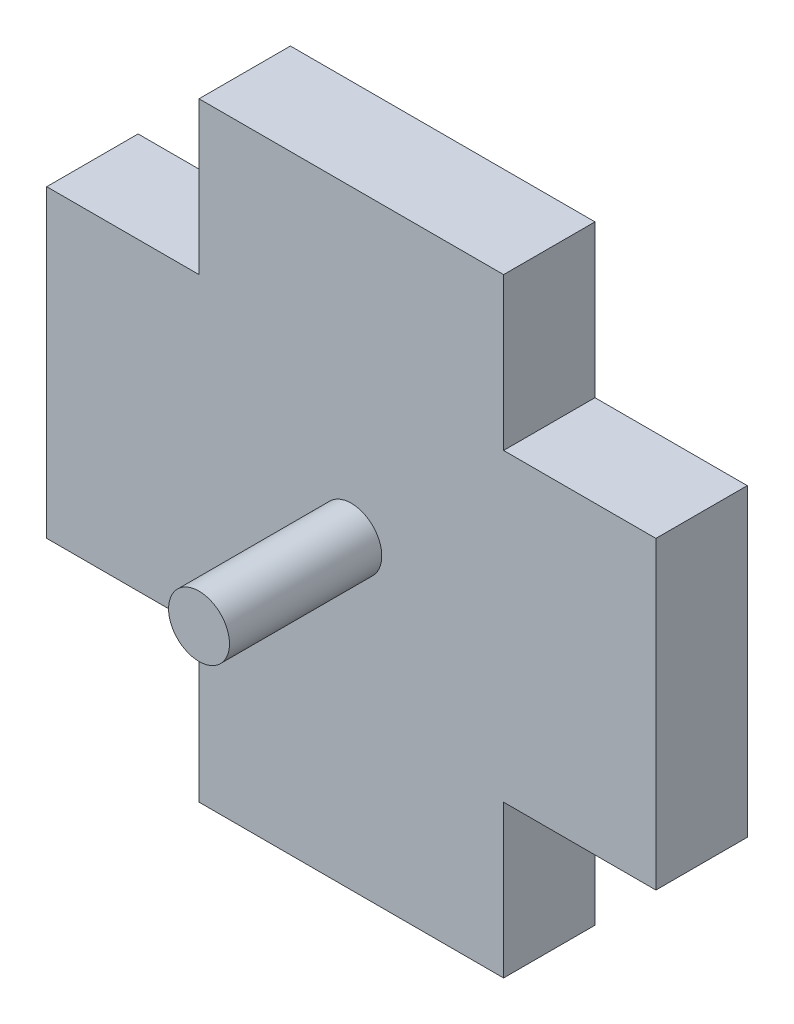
ISO-10303-21;
HEADER;
FILE_DESCRIPTION(('STEP AP214'),'2;1');
FILE_NAME('part.step','',(''),(''),'','','');
FILE_SCHEMA(('AUTOMOTIVE_DESIGN { 1 0 10303 214 1 1 1 1 }'));
ENDSEC;
DATA;
#1=APPLICATION_CONTEXT('core data for automotive mechanical design processes');
#2=APPLICATION_PROTOCOL_DEFINITION('international standard','automotive_design',2000,#1);
#3=PRODUCT_CONTEXT('',#1,'mechanical');
#4=PRODUCT('Part','Part','',(#3));
#5=PRODUCT_RELATED_PRODUCT_CATEGORY('part','',(#4));
#6=PRODUCT_DEFINITION_FORMATION('','',#4);
#7=PRODUCT_DEFINITION_CONTEXT('part definition',#1,'design');
#8=PRODUCT_DEFINITION('design','',#6,#7);
#9=PRODUCT_DEFINITION_SHAPE('','',#8);
#10=(LENGTH_UNIT() NAMED_UNIT(*) SI_UNIT(.MILLI.,.METRE.));
#11=(NAMED_UNIT(*) PLANE_ANGLE_UNIT() SI_UNIT($,.RADIAN.));
#12=(NAMED_UNIT(*) SI_UNIT($,.STERADIAN.) SOLID_ANGLE_UNIT());
#13=UNCERTAINTY_MEASURE_WITH_UNIT(LENGTH_MEASURE(1.E-05),#10,'distance_accuracy_value','');
#14=(GEOMETRIC_REPRESENTATION_CONTEXT(3) GLOBAL_UNCERTAINTY_ASSIGNED_CONTEXT((#13)) GLOBAL_UNIT_ASSIGNED_CONTEXT((#10,
#11,#12)) REPRESENTATION_CONTEXT('',''));
#15=CARTESIAN_POINT('',(0.,0.,0.));
#16=DIRECTION('',(0.,0.,1.));
#17=DIRECTION('',(1.,0.,0.));
#18=AXIS2_PLACEMENT_3D('',#15,#16,#17);
#19=CARTESIAN_POINT('',(-10.,5.,0.));
#20=DIRECTION('',(0.,0.,-1.));
#21=DIRECTION('',(-1.,0.,0.));
#22=AXIS2_PLACEMENT_3D('',#19,#20,#21);
#23=PLANE('',#22);
#24=DIRECTION('',(0.,-1.,0.));
#25=VECTOR('',#24,1.);
#26=CARTESIAN_POINT('',(-10.,-5.,0.));
#27=LINE('',#26,#25);
#28=CARTESIAN_POINT('',(-10.,5.,0.));
#29=VERTEX_POINT('',#28);
#30=CARTESIAN_POINT('',(-10.,-5.,0.));
#31=VERTEX_POINT('',#30);
#32=EDGE_CURVE('E154',#29,#31,#27,.T.);
#33=ORIENTED_EDGE('',*,*,#32,.T.);
#34=DIRECTION('',(1.,0.,0.));
#35=VECTOR('',#34,1.);
#36=CARTESIAN_POINT('',(-4.99999999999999,-5.,0.));
#37=LINE('',#36,#35);
#38=CARTESIAN_POINT('',(-4.99999999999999,-5.,0.));
#39=VERTEX_POINT('',#38);
#40=EDGE_CURVE('E157',#31,#39,#37,.T.);
#41=ORIENTED_EDGE('',*,*,#40,.T.);
#42=DIRECTION('',(0.,-1.,0.));
#43=VECTOR('',#42,1.);
#44=CARTESIAN_POINT('',(-4.99999999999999,-10.,0.));
#45=LINE('',#44,#43);
#46=CARTESIAN_POINT('',(-4.99999999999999,-10.,0.));
#47=VERTEX_POINT('',#46);
#48=EDGE_CURVE('E161',#39,#47,#45,.T.);
#49=ORIENTED_EDGE('',*,*,#48,.T.);
#50=DIRECTION('',(1.,0.,0.));
#51=VECTOR('',#50,1.);
#52=CARTESIAN_POINT('',(5.,-10.,0.));
#53=LINE('',#52,#51);
#54=CARTESIAN_POINT('',(5.,-10.,0.));
#55=VERTEX_POINT('',#54);
#56=EDGE_CURVE('E164',#47,#55,#53,.T.);
#57=ORIENTED_EDGE('',*,*,#56,.T.);
#58=DIRECTION('',(0.,1.,0.));
#59=VECTOR('',#58,1.);
#60=CARTESIAN_POINT('',(5.,-5.,0.));
#61=LINE('',#60,#59);
#62=CARTESIAN_POINT('',(5.,-5.,0.));
#63=VERTEX_POINT('',#62);
#64=EDGE_CURVE('E167',#55,#63,#61,.T.);
#65=ORIENTED_EDGE('',*,*,#64,.T.);
#66=DIRECTION('',(1.,0.,0.));
#67=VECTOR('',#66,1.);
#68=CARTESIAN_POINT('',(10.,-5.,0.));
#69=LINE('',#68,#67);
#70=CARTESIAN_POINT('',(10.,-5.,0.));
#71=VERTEX_POINT('',#70);
#72=EDGE_CURVE('E170',#63,#71,#69,.T.);
#73=ORIENTED_EDGE('',*,*,#72,.T.);
#74=DIRECTION('',(0.,1.,0.));
#75=VECTOR('',#74,1.);
#76=CARTESIAN_POINT('',(9.99999999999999,5.,0.));
#77=LINE('',#76,#75);
#78=CARTESIAN_POINT('',(9.99999999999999,5.,0.));
#79=VERTEX_POINT('',#78);
#80=EDGE_CURVE('E173',#71,#79,#77,.T.);
#81=ORIENTED_EDGE('',*,*,#80,.T.);
#82=DIRECTION('',(-1.,0.,0.));
#83=VECTOR('',#82,1.);
#84=CARTESIAN_POINT('',(4.99999999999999,5.,0.));
#85=LINE('',#84,#83);
#86=CARTESIAN_POINT('',(4.99999999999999,5.,0.));
#87=VERTEX_POINT('',#86);
#88=EDGE_CURVE('E176',#79,#87,#85,.T.);
#89=ORIENTED_EDGE('',*,*,#88,.T.);
#90=DIRECTION('',(0.,1.,0.));
#91=VECTOR('',#90,1.);
#92=CARTESIAN_POINT('',(4.99999999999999,10.,0.));
#93=LINE('',#92,#91);
#94=CARTESIAN_POINT('',(4.99999999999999,10.,0.));
#95=VERTEX_POINT('',#94);
#96=EDGE_CURVE('E179',#87,#95,#93,.T.);
#97=ORIENTED_EDGE('',*,*,#96,.T.);
#98=DIRECTION('',(-1.,0.,0.));
#99=VECTOR('',#98,1.);
#100=CARTESIAN_POINT('',(-5.00000000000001,10.,0.));
#101=LINE('',#100,#99);
#102=CARTESIAN_POINT('',(-5.00000000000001,10.,0.));
#103=VERTEX_POINT('',#102);
#104=EDGE_CURVE('E182',#95,#103,#101,.T.);
#105=ORIENTED_EDGE('',*,*,#104,.T.);
#106=DIRECTION('',(0.,-1.,0.));
#107=VECTOR('',#106,1.);
#108=CARTESIAN_POINT('',(-5.,5.,0.));
#109=LINE('',#108,#107);
#110=CARTESIAN_POINT('',(-5.,5.,0.));
#111=VERTEX_POINT('',#110);
#112=EDGE_CURVE('E131',#103,#111,#109,.T.);
#113=ORIENTED_EDGE('',*,*,#112,.T.);
#114=DIRECTION('',(-1.,0.,0.));
#115=VECTOR('',#114,1.);
#116=CARTESIAN_POINT('',(-10.,5.,0.));
#117=LINE('',#116,#115);
#118=EDGE_CURVE('E185',#111,#29,#117,.T.);
#119=ORIENTED_EDGE('',*,*,#118,.T.);
#120=EDGE_LOOP('',(#33,#41,#49,#57,#65,#73,#81,#89,#97,#105,#113,#119));
#121=FACE_BOUND('',#120,.T.);
#122=CARTESIAN_POINT('',(0.,0.,0.));
#123=DIRECTION('',(0.,0.,-1.));
#124=DIRECTION('',(-1.,0.,0.));
#125=AXIS2_PLACEMENT_3D('',#122,#123,#124);
#126=CIRCLE('',#125,1.);
#127=CARTESIAN_POINT('',(-1.,0.,0.));
#128=VERTEX_POINT('',#127);
#129=EDGE_CURVE('E11',#128,#128,#126,.F.);
#130=ORIENTED_EDGE('',*,*,#129,.F.);
#131=EDGE_LOOP('',(#130));
#132=FACE_BOUND('',#131,.T.);
#133=ADVANCED_FACE('F31',(#121,#132),#23,.F.);
#134=CARTESIAN_POINT('',(-10.,-5.,-3.));
#135=DIRECTION('',(-1.,0.,0.));
#136=DIRECTION('',(0.,-1.,0.));
#137=AXIS2_PLACEMENT_3D('',#134,#135,#136);
#138=PLANE('',#137);
#139=ORIENTED_EDGE('',*,*,#32,.F.);
#140=DIRECTION('',(0.,0.,1.));
#141=VECTOR('',#140,1.);
#142=CARTESIAN_POINT('',(-10.,5.,-3.));
#143=LINE('',#142,#141);
#144=CARTESIAN_POINT('',(-10.,5.,-3.));
#145=VERTEX_POINT('',#144);
#146=EDGE_CURVE('E40',#145,#29,#143,.T.);
#147=ORIENTED_EDGE('',*,*,#146,.F.);
#148=DIRECTION('',(0.,-1.,0.));
#149=VECTOR('',#148,1.);
#150=CARTESIAN_POINT('',(-10.,-5.,-3.));
#151=LINE('',#150,#149);
#152=CARTESIAN_POINT('',(-10.,-5.,-3.));
#153=VERTEX_POINT('',#152);
#154=EDGE_CURVE('E188',#145,#153,#151,.T.);
#155=ORIENTED_EDGE('',*,*,#154,.T.);
#156=DIRECTION('',(0.,0.,1.));
#157=VECTOR('',#156,1.);
#158=CARTESIAN_POINT('',(-10.,-5.,-3.));
#159=LINE('',#158,#157);
#160=EDGE_CURVE('E100',#153,#31,#159,.T.);
#161=ORIENTED_EDGE('',*,*,#160,.T.);
#162=EDGE_LOOP('',(#139,#147,#155,#161));
#163=FACE_BOUND('',#162,.T.);
#164=ADVANCED_FACE('F33',(#163),#138,.T.);
#165=CARTESIAN_POINT('',(-10.,5.,-3.));
#166=DIRECTION('',(0.,1.,0.));
#167=DIRECTION('',(-1.,0.,0.));
#168=AXIS2_PLACEMENT_3D('',#165,#166,#167);
#169=PLANE('',#168);
#170=ORIENTED_EDGE('',*,*,#118,.F.);
#171=DIRECTION('',(0.,0.,1.));
#172=VECTOR('',#171,1.);
#173=CARTESIAN_POINT('',(-5.,5.,-3.));
#174=LINE('',#173,#172);
#175=CARTESIAN_POINT('',(-5.,5.,-3.));
#176=VERTEX_POINT('',#175);
#177=EDGE_CURVE('E88',#176,#111,#174,.T.);
#178=ORIENTED_EDGE('',*,*,#177,.F.);
#179=DIRECTION('',(-1.,0.,0.));
#180=VECTOR('',#179,1.);
#181=CARTESIAN_POINT('',(-10.,5.,-3.));
#182=LINE('',#181,#180);
#183=EDGE_CURVE('E144',#176,#145,#182,.T.);
#184=ORIENTED_EDGE('',*,*,#183,.T.);
#185=ORIENTED_EDGE('',*,*,#146,.T.);
#186=EDGE_LOOP('',(#170,#178,#184,#185));
#187=FACE_BOUND('',#186,.T.);
#188=ADVANCED_FACE('F209',(#187),#169,.T.);
#189=CARTESIAN_POINT('',(-5.,5.,-3.));
#190=DIRECTION('',(-1.,0.,0.));
#191=DIRECTION('',(0.,-1.,0.));
#192=AXIS2_PLACEMENT_3D('',#189,#190,#191);
#193=PLANE('',#192);
#194=ORIENTED_EDGE('',*,*,#112,.F.);
#195=DIRECTION('',(0.,0.,1.));
#196=VECTOR('',#195,1.);
#197=CARTESIAN_POINT('',(-5.00000000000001,10.,-3.));
#198=LINE('',#197,#196);
#199=CARTESIAN_POINT('',(-5.00000000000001,10.,-3.));
#200=VERTEX_POINT('',#199);
#201=EDGE_CURVE('E126',#200,#103,#198,.T.);
#202=ORIENTED_EDGE('',*,*,#201,.F.);
#203=DIRECTION('',(0.,-1.,0.));
#204=VECTOR('',#203,1.);
#205=CARTESIAN_POINT('',(-5.,5.,-3.));
#206=LINE('',#205,#204);
#207=EDGE_CURVE('E129',#200,#176,#206,.T.);
#208=ORIENTED_EDGE('',*,*,#207,.T.);
#209=ORIENTED_EDGE('',*,*,#177,.T.);
#210=EDGE_LOOP('',(#194,#202,#208,#209));
#211=FACE_BOUND('',#210,.T.);
#212=ADVANCED_FACE('F128',(#211),#193,.T.);
#213=CARTESIAN_POINT('',(-5.00000000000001,10.,-3.));
#214=DIRECTION('',(0.,1.,0.));
#215=DIRECTION('',(-1.,0.,0.));
#216=AXIS2_PLACEMENT_3D('',#213,#214,#215);
#217=PLANE('',#216);
#218=ORIENTED_EDGE('',*,*,#104,.F.);
#219=DIRECTION('',(0.,0.,1.));
#220=VECTOR('',#219,1.);
#221=CARTESIAN_POINT('',(4.99999999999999,10.,-3.));
#222=LINE('',#221,#220);
#223=CARTESIAN_POINT('',(4.99999999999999,10.,-3.));
#224=VERTEX_POINT('',#223);
#225=EDGE_CURVE('E136',#224,#95,#222,.T.);
#226=ORIENTED_EDGE('',*,*,#225,.F.);
#227=DIRECTION('',(-1.,0.,0.));
#228=VECTOR('',#227,1.);
#229=CARTESIAN_POINT('',(-5.00000000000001,10.,-3.));
#230=LINE('',#229,#228);
#231=EDGE_CURVE('E142',#224,#200,#230,.T.);
#232=ORIENTED_EDGE('',*,*,#231,.T.);
#233=ORIENTED_EDGE('',*,*,#201,.T.);
#234=EDGE_LOOP('',(#218,#226,#232,#233));
#235=FACE_BOUND('',#234,.T.);
#236=ADVANCED_FACE('F146',(#235),#217,.T.);
#237=CARTESIAN_POINT('',(4.99999999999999,10.,-3.));
#238=DIRECTION('',(1.,0.,0.));
#239=DIRECTION('',(0.,1.,0.));
#240=AXIS2_PLACEMENT_3D('',#237,#238,#239);
#241=PLANE('',#240);
#242=ORIENTED_EDGE('',*,*,#96,.F.);
#243=DIRECTION('',(0.,0.,1.));
#244=VECTOR('',#243,1.);
#245=CARTESIAN_POINT('',(4.99999999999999,5.,-3.));
#246=LINE('',#245,#244);
#247=CARTESIAN_POINT('',(4.99999999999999,5.,-3.));
#248=VERTEX_POINT('',#247);
#249=EDGE_CURVE('E192',#248,#87,#246,.T.);
#250=ORIENTED_EDGE('',*,*,#249,.F.);
#251=DIRECTION('',(0.,1.,0.));
#252=VECTOR('',#251,1.);
#253=CARTESIAN_POINT('',(4.99999999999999,10.,-3.));
#254=LINE('',#253,#252);
#255=EDGE_CURVE('E147',#248,#224,#254,.T.);
#256=ORIENTED_EDGE('',*,*,#255,.T.);
#257=ORIENTED_EDGE('',*,*,#225,.T.);
#258=EDGE_LOOP('',(#242,#250,#256,#257));
#259=FACE_BOUND('',#258,.T.);
#260=ADVANCED_FACE('F280',(#259),#241,.T.);
#261=CARTESIAN_POINT('',(4.99999999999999,5.,-3.));
#262=DIRECTION('',(0.,1.,0.));
#263=DIRECTION('',(-1.,0.,0.));
#264=AXIS2_PLACEMENT_3D('',#261,#262,#263);
#265=PLANE('',#264);
#266=ORIENTED_EDGE('',*,*,#88,.F.);
#267=DIRECTION('',(0.,0.,1.));
#268=VECTOR('',#267,1.);
#269=CARTESIAN_POINT('',(9.99999999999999,5.,-3.));
#270=LINE('',#269,#268);
#271=CARTESIAN_POINT('',(9.99999999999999,5.,-3.));
#272=VERTEX_POINT('',#271);
#273=EDGE_CURVE('E194',#272,#79,#270,.T.);
#274=ORIENTED_EDGE('',*,*,#273,.F.);
#275=DIRECTION('',(-1.,0.,0.));
#276=VECTOR('',#275,1.);
#277=CARTESIAN_POINT('',(4.99999999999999,5.,-3.));
#278=LINE('',#277,#276);
#279=EDGE_CURVE('E149',#272,#248,#278,.T.);
#280=ORIENTED_EDGE('',*,*,#279,.T.);
#281=ORIENTED_EDGE('',*,*,#249,.T.);
#282=EDGE_LOOP('',(#266,#274,#280,#281));
#283=FACE_BOUND('',#282,.T.);
#284=ADVANCED_FACE('F258',(#283),#265,.T.);
#285=CARTESIAN_POINT('',(9.99999999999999,5.,-3.));
#286=DIRECTION('',(1.,0.,0.));
#287=DIRECTION('',(0.,1.,0.));
#288=AXIS2_PLACEMENT_3D('',#285,#286,#287);
#289=PLANE('',#288);
#290=ORIENTED_EDGE('',*,*,#80,.F.);
#291=DIRECTION('',(0.,0.,1.));
#292=VECTOR('',#291,1.);
#293=CARTESIAN_POINT('',(10.,-5.,-3.));
#294=LINE('',#293,#292);
#295=CARTESIAN_POINT('',(10.,-5.,-3.));
#296=VERTEX_POINT('',#295);
#297=EDGE_CURVE('E196',#296,#71,#294,.T.);
#298=ORIENTED_EDGE('',*,*,#297,.F.);
#299=DIRECTION('',(0.,1.,0.));
#300=VECTOR('',#299,1.);
#301=CARTESIAN_POINT('',(9.99999999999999,5.,-3.));
#302=LINE('',#301,#300);
#303=EDGE_CURVE('E252',#296,#272,#302,.T.);
#304=ORIENTED_EDGE('',*,*,#303,.T.);
#305=ORIENTED_EDGE('',*,*,#273,.T.);
#306=EDGE_LOOP('',(#290,#298,#304,#305));
#307=FACE_BOUND('',#306,.T.);
#308=ADVANCED_FACE('F264',(#307),#289,.T.);
#309=CARTESIAN_POINT('',(10.,-5.,-3.));
#310=DIRECTION('',(0.,-1.,0.));
#311=DIRECTION('',(1.,0.,0.));
#312=AXIS2_PLACEMENT_3D('',#309,#310,#311);
#313=PLANE('',#312);
#314=ORIENTED_EDGE('',*,*,#72,.F.);
#315=DIRECTION('',(0.,0.,1.));
#316=VECTOR('',#315,1.);
#317=CARTESIAN_POINT('',(5.,-5.,-3.));
#318=LINE('',#317,#316);
#319=CARTESIAN_POINT('',(5.,-5.,-3.));
#320=VERTEX_POINT('',#319);
#321=EDGE_CURVE('E198',#320,#63,#318,.T.);
#322=ORIENTED_EDGE('',*,*,#321,.F.);
#323=DIRECTION('',(1.,0.,0.));
#324=VECTOR('',#323,1.);
#325=CARTESIAN_POINT('',(10.,-5.,-3.));
#326=LINE('',#325,#324);
#327=EDGE_CURVE('E249',#320,#296,#326,.T.);
#328=ORIENTED_EDGE('',*,*,#327,.T.);
#329=ORIENTED_EDGE('',*,*,#297,.T.);
#330=EDGE_LOOP('',(#314,#322,#328,#329));
#331=FACE_BOUND('',#330,.T.);
#332=ADVANCED_FACE('F267',(#331),#313,.T.);
#333=CARTESIAN_POINT('',(5.,-5.,-3.));
#334=DIRECTION('',(1.,0.,0.));
#335=DIRECTION('',(0.,1.,0.));
#336=AXIS2_PLACEMENT_3D('',#333,#334,#335);
#337=PLANE('',#336);
#338=ORIENTED_EDGE('',*,*,#64,.F.);
#339=DIRECTION('',(0.,0.,1.));
#340=VECTOR('',#339,1.);
#341=CARTESIAN_POINT('',(5.,-10.,-3.));
#342=LINE('',#341,#340);
#343=CARTESIAN_POINT('',(5.,-10.,-3.));
#344=VERTEX_POINT('',#343);
#345=EDGE_CURVE('E200',#344,#55,#342,.T.);
#346=ORIENTED_EDGE('',*,*,#345,.F.);
#347=DIRECTION('',(0.,1.,0.));
#348=VECTOR('',#347,1.);
#349=CARTESIAN_POINT('',(5.,-5.,-3.));
#350=LINE('',#349,#348);
#351=EDGE_CURVE('E246',#344,#320,#350,.T.);
#352=ORIENTED_EDGE('',*,*,#351,.T.);
#353=ORIENTED_EDGE('',*,*,#321,.T.);
#354=EDGE_LOOP('',(#338,#346,#352,#353));
#355=FACE_BOUND('',#354,.T.);
#356=ADVANCED_FACE('F272',(#355),#337,.T.);
#357=CARTESIAN_POINT('',(5.,-10.,-3.));
#358=DIRECTION('',(0.,-1.,0.));
#359=DIRECTION('',(1.,0.,0.));
#360=AXIS2_PLACEMENT_3D('',#357,#358,#359);
#361=PLANE('',#360);
#362=ORIENTED_EDGE('',*,*,#56,.F.);
#363=DIRECTION('',(0.,0.,1.));
#364=VECTOR('',#363,1.);
#365=CARTESIAN_POINT('',(-4.99999999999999,-10.,-3.));
#366=LINE('',#365,#364);
#367=CARTESIAN_POINT('',(-4.99999999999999,-10.,-3.));
#368=VERTEX_POINT('',#367);
#369=EDGE_CURVE('E202',#368,#47,#366,.T.);
#370=ORIENTED_EDGE('',*,*,#369,.F.);
#371=DIRECTION('',(1.,0.,0.));
#372=VECTOR('',#371,1.);
#373=CARTESIAN_POINT('',(5.,-10.,-3.));
#374=LINE('',#373,#372);
#375=EDGE_CURVE('E243',#368,#344,#374,.T.);
#376=ORIENTED_EDGE('',*,*,#375,.T.);
#377=ORIENTED_EDGE('',*,*,#345,.T.);
#378=EDGE_LOOP('',(#362,#370,#376,#377));
#379=FACE_BOUND('',#378,.T.);
#380=ADVANCED_FACE('F275',(#379),#361,.T.);
#381=CARTESIAN_POINT('',(-4.99999999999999,-10.,-3.));
#382=DIRECTION('',(-1.,0.,0.));
#383=DIRECTION('',(0.,-1.,0.));
#384=AXIS2_PLACEMENT_3D('',#381,#382,#383);
#385=PLANE('',#384);
#386=ORIENTED_EDGE('',*,*,#48,.F.);
#387=DIRECTION('',(0.,0.,1.));
#388=VECTOR('',#387,1.);
#389=CARTESIAN_POINT('',(-4.99999999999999,-5.,-3.));
#390=LINE('',#389,#388);
#391=CARTESIAN_POINT('',(-4.99999999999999,-5.,-3.));
#392=VERTEX_POINT('',#391);
#393=EDGE_CURVE('E204',#392,#39,#390,.T.);
#394=ORIENTED_EDGE('',*,*,#393,.F.);
#395=DIRECTION('',(0.,-1.,0.));
#396=VECTOR('',#395,1.);
#397=CARTESIAN_POINT('',(-4.99999999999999,-10.,-3.));
#398=LINE('',#397,#396);
#399=EDGE_CURVE('E240',#392,#368,#398,.T.);
#400=ORIENTED_EDGE('',*,*,#399,.T.);
#401=ORIENTED_EDGE('',*,*,#369,.T.);
#402=EDGE_LOOP('',(#386,#394,#400,#401));
#403=FACE_BOUND('',#402,.T.);
#404=ADVANCED_FACE('F278',(#403),#385,.T.);
#405=CARTESIAN_POINT('',(-4.99999999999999,-5.,-3.));
#406=DIRECTION('',(0.,-1.,0.));
#407=DIRECTION('',(1.,0.,0.));
#408=AXIS2_PLACEMENT_3D('',#405,#406,#407);
#409=PLANE('',#408);
#410=ORIENTED_EDGE('',*,*,#40,.F.);
#411=ORIENTED_EDGE('',*,*,#160,.F.);
#412=DIRECTION('',(1.,0.,0.));
#413=VECTOR('',#412,1.);
#414=CARTESIAN_POINT('',(-4.99999999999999,-5.,-3.));
#415=LINE('',#414,#413);
#416=EDGE_CURVE('E238',#153,#392,#415,.T.);
#417=ORIENTED_EDGE('',*,*,#416,.T.);
#418=ORIENTED_EDGE('',*,*,#393,.T.);
#419=EDGE_LOOP('',(#410,#411,#417,#418));
#420=FACE_BOUND('',#419,.T.);
#421=ADVANCED_FACE('F205',(#420),#409,.T.);
#422=CARTESIAN_POINT('',(-10.,5.,-3.));
#423=DIRECTION('',(0.,0.,-1.));
#424=DIRECTION('',(-1.,0.,0.));
#425=AXIS2_PLACEMENT_3D('',#422,#423,#424);
#426=PLANE('',#425);
#427=ORIENTED_EDGE('',*,*,#154,.F.);
#428=ORIENTED_EDGE('',*,*,#183,.F.);
#429=ORIENTED_EDGE('',*,*,#207,.F.);
#430=ORIENTED_EDGE('',*,*,#231,.F.);
#431=ORIENTED_EDGE('',*,*,#255,.F.);
#432=ORIENTED_EDGE('',*,*,#279,.F.);
#433=ORIENTED_EDGE('',*,*,#303,.F.);
#434=ORIENTED_EDGE('',*,*,#327,.F.);
#435=ORIENTED_EDGE('',*,*,#351,.F.);
#436=ORIENTED_EDGE('',*,*,#375,.F.);
#437=ORIENTED_EDGE('',*,*,#399,.F.);
#438=ORIENTED_EDGE('',*,*,#416,.F.);
#439=EDGE_LOOP('',(#427,#428,#429,#430,#431,#432,#433,#434,#435,#436,#437,#438));
#440=FACE_BOUND('',#439,.T.);
#441=ADVANCED_FACE('F140',(#440),#426,.T.);
#442=CARTESIAN_POINT('',(0.,0.,5.));
#443=DIRECTION('',(0.,0.,-1.));
#444=DIRECTION('',(-1.,0.,0.));
#445=AXIS2_PLACEMENT_3D('',#442,#443,#444);
#446=CYLINDRICAL_SURFACE('',#445,1.);
#447=CARTESIAN_POINT('',(0.,0.,5.));
#448=DIRECTION('',(0.,0.,1.));
#449=DIRECTION('',(1.,0.,0.));
#450=AXIS2_PLACEMENT_3D('',#447,#448,#449);
#451=CIRCLE('',#450,1.);
#452=CARTESIAN_POINT('',(1.,0.,5.));
#453=VERTEX_POINT('',#452);
#454=EDGE_CURVE('E158',#453,#453,#451,.T.);
#455=ORIENTED_EDGE('',*,*,#454,.F.);
#456=EDGE_LOOP('',(#455));
#457=FACE_BOUND('',#456,.T.);
#458=ORIENTED_EDGE('',*,*,#129,.T.);
#459=EDGE_LOOP('',(#458));
#460=FACE_BOUND('',#459,.T.);
#461=ADVANCED_FACE('F224',(#457,#460),#446,.T.);
#462=CARTESIAN_POINT('',(0.,0.,5.));
#463=DIRECTION('',(0.,0.,1.));
#464=DIRECTION('',(1.,0.,0.));
#465=AXIS2_PLACEMENT_3D('',#462,#463,#464);
#466=PLANE('',#465);
#467=ORIENTED_EDGE('',*,*,#454,.T.);
#468=EDGE_LOOP('',(#467));
#469=FACE_BOUND('',#468,.T.);
#470=ADVANCED_FACE('F227',(#469),#466,.T.);
#471=CLOSED_SHELL('',(#133,#164,#188,#212,#236,#260,#284,#308,#332,#356,#380,#404,#421,#441,
#461,#470));
#472=MANIFOLD_SOLID_BREP('B2',#471);
#473=ADVANCED_BREP_SHAPE_REPRESENTATION('',(#18,#472),#14);
#474=SHAPE_DEFINITION_REPRESENTATION(#9,#473);
ENDSEC;
END-ISO-10303-21;
